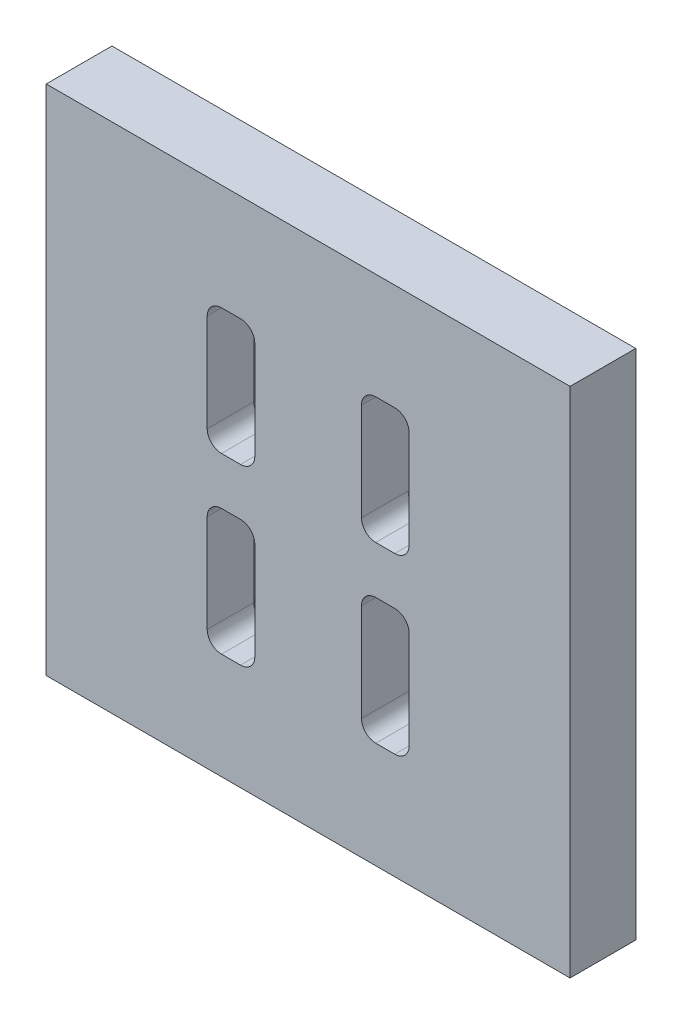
ISO-10303-21;
HEADER;
FILE_DESCRIPTION(('STEP AP214'),'2;1');
FILE_NAME('part.step','',(''),(''),'','','');
FILE_SCHEMA(('AUTOMOTIVE_DESIGN { 1 0 10303 214 1 1 1 1 }'));
ENDSEC;
DATA;
#1=APPLICATION_CONTEXT('core data for automotive mechanical design processes');
#2=APPLICATION_PROTOCOL_DEFINITION('international standard','automotive_design',2000,#1);
#3=PRODUCT_CONTEXT('',#1,'mechanical');
#4=PRODUCT('Part','Part','',(#3));
#5=PRODUCT_RELATED_PRODUCT_CATEGORY('part','',(#4));
#6=PRODUCT_DEFINITION_FORMATION('','',#4);
#7=PRODUCT_DEFINITION_CONTEXT('part definition',#1,'design');
#8=PRODUCT_DEFINITION('design','',#6,#7);
#9=PRODUCT_DEFINITION_SHAPE('','',#8);
#10=(LENGTH_UNIT() NAMED_UNIT(*) SI_UNIT(.MILLI.,.METRE.));
#11=(NAMED_UNIT(*) PLANE_ANGLE_UNIT() SI_UNIT($,.RADIAN.));
#12=(NAMED_UNIT(*) SI_UNIT($,.STERADIAN.) SOLID_ANGLE_UNIT());
#13=UNCERTAINTY_MEASURE_WITH_UNIT(LENGTH_MEASURE(1.E-05),#10,'distance_accuracy_value','');
#14=(GEOMETRIC_REPRESENTATION_CONTEXT(3) GLOBAL_UNCERTAINTY_ASSIGNED_CONTEXT((#13)) GLOBAL_UNIT_ASSIGNED_CONTEXT((#10,
#11,#12)) REPRESENTATION_CONTEXT('',''));
#15=CARTESIAN_POINT('',(0.,0.,0.));
#16=DIRECTION('',(0.,0.,1.));
#17=DIRECTION('',(1.,0.,0.));
#18=AXIS2_PLACEMENT_3D('',#15,#16,#17);
#19=CARTESIAN_POINT('',(0.,0.,8.763));
#20=DIRECTION('',(1.,0.,0.));
#21=DIRECTION('',(0.,0.,-1.));
#22=AXIS2_PLACEMENT_3D('',#19,#20,#21);
#23=PLANE('',#22);
#24=DIRECTION('',(0.,-1.,0.));
#25=VECTOR('',#24,1.);
#26=CARTESIAN_POINT('',(0.,0.,0.));
#27=LINE('',#26,#25);
#28=CARTESIAN_POINT('',(0.,68.326,0.));
#29=VERTEX_POINT('',#28);
#30=CARTESIAN_POINT('',(0.,0.,0.));
#31=VERTEX_POINT('',#30);
#32=EDGE_CURVE('E578',#29,#31,#27,.T.);
#33=ORIENTED_EDGE('',*,*,#32,.T.);
#34=DIRECTION('',(0.,0.,-1.));
#35=VECTOR('',#34,1.);
#36=CARTESIAN_POINT('',(0.,0.,8.763));
#37=LINE('',#36,#35);
#38=CARTESIAN_POINT('',(0.,0.,8.763));
#39=VERTEX_POINT('',#38);
#40=EDGE_CURVE('E621',#39,#31,#37,.T.);
#41=ORIENTED_EDGE('',*,*,#40,.F.);
#42=DIRECTION('',(0.,-1.,0.));
#43=VECTOR('',#42,1.);
#44=CARTESIAN_POINT('',(0.,0.,8.763));
#45=LINE('',#44,#43);
#46=CARTESIAN_POINT('',(0.,68.326,8.763));
#47=VERTEX_POINT('',#46);
#48=EDGE_CURVE('E595',#47,#39,#45,.T.);
#49=ORIENTED_EDGE('',*,*,#48,.F.);
#50=DIRECTION('',(0.,0.,-1.));
#51=VECTOR('',#50,1.);
#52=CARTESIAN_POINT('',(0.,68.326,8.763));
#53=LINE('',#52,#51);
#54=EDGE_CURVE('E605',#47,#29,#53,.T.);
#55=ORIENTED_EDGE('',*,*,#54,.T.);
#56=EDGE_LOOP('',(#33,#41,#49,#55));
#57=FACE_BOUND('',#56,.T.);
#58=ADVANCED_FACE('F32',(#57),#23,.F.);
#59=CARTESIAN_POINT('',(0.,0.,8.763));
#60=DIRECTION('',(0.,1.,0.));
#61=DIRECTION('',(0.,0.,1.));
#62=AXIS2_PLACEMENT_3D('',#59,#60,#61);
#63=PLANE('',#62);
#64=DIRECTION('',(1.,0.,0.));
#65=VECTOR('',#64,1.);
#66=CARTESIAN_POINT('',(0.,0.,0.));
#67=LINE('',#66,#65);
#68=CARTESIAN_POINT('',(69.85,0.,0.));
#69=VERTEX_POINT('',#68);
#70=EDGE_CURVE('E608',#31,#69,#67,.T.);
#71=ORIENTED_EDGE('',*,*,#70,.T.);
#72=DIRECTION('',(0.,0.,-1.));
#73=VECTOR('',#72,1.);
#74=CARTESIAN_POINT('',(69.85,0.,8.763));
#75=LINE('',#74,#73);
#76=CARTESIAN_POINT('',(69.85,0.,8.763));
#77=VERTEX_POINT('',#76);
#78=EDGE_CURVE('E618',#77,#69,#75,.T.);
#79=ORIENTED_EDGE('',*,*,#78,.F.);
#80=DIRECTION('',(1.,0.,0.));
#81=VECTOR('',#80,1.);
#82=CARTESIAN_POINT('',(0.,0.,8.763));
#83=LINE('',#82,#81);
#84=EDGE_CURVE('E598',#39,#77,#83,.T.);
#85=ORIENTED_EDGE('',*,*,#84,.F.);
#86=ORIENTED_EDGE('',*,*,#40,.T.);
#87=EDGE_LOOP('',(#71,#79,#85,#86));
#88=FACE_BOUND('',#87,.T.);
#89=ADVANCED_FACE('F750',(#88),#63,.F.);
#90=CARTESIAN_POINT('',(69.85,0.,8.763));
#91=DIRECTION('',(-1.,0.,0.));
#92=DIRECTION('',(0.,0.,1.));
#93=AXIS2_PLACEMENT_3D('',#90,#91,#92);
#94=PLANE('',#93);
#95=DIRECTION('',(0.,1.,0.));
#96=VECTOR('',#95,1.);
#97=CARTESIAN_POINT('',(69.85,0.,0.));
#98=LINE('',#97,#96);
#99=CARTESIAN_POINT('',(69.85,68.326,0.));
#100=VERTEX_POINT('',#99);
#101=EDGE_CURVE('E610',#69,#100,#98,.T.);
#102=ORIENTED_EDGE('',*,*,#101,.T.);
#103=DIRECTION('',(0.,0.,-1.));
#104=VECTOR('',#103,1.);
#105=CARTESIAN_POINT('',(69.85,68.326,8.763));
#106=LINE('',#105,#104);
#107=CARTESIAN_POINT('',(69.85,68.326,8.763));
#108=VERTEX_POINT('',#107);
#109=EDGE_CURVE('E615',#108,#100,#106,.T.);
#110=ORIENTED_EDGE('',*,*,#109,.F.);
#111=DIRECTION('',(0.,1.,0.));
#112=VECTOR('',#111,1.);
#113=CARTESIAN_POINT('',(69.85,0.,8.763));
#114=LINE('',#113,#112);
#115=EDGE_CURVE('E601',#77,#108,#114,.T.);
#116=ORIENTED_EDGE('',*,*,#115,.F.);
#117=ORIENTED_EDGE('',*,*,#78,.T.);
#118=EDGE_LOOP('',(#102,#110,#116,#117));
#119=FACE_BOUND('',#118,.T.);
#120=ADVANCED_FACE('F755',(#119),#94,.F.);
#121=CARTESIAN_POINT('',(0.,68.326,8.763));
#122=DIRECTION('',(0.,-1.,0.));
#123=DIRECTION('',(0.,0.,-1.));
#124=AXIS2_PLACEMENT_3D('',#121,#122,#123);
#125=PLANE('',#124);
#126=DIRECTION('',(-1.,0.,0.));
#127=VECTOR('',#126,1.);
#128=CARTESIAN_POINT('',(0.,68.326,0.));
#129=LINE('',#128,#127);
#130=EDGE_CURVE('E599',#100,#29,#129,.T.);
#131=ORIENTED_EDGE('',*,*,#130,.T.);
#132=ORIENTED_EDGE('',*,*,#54,.F.);
#133=DIRECTION('',(-1.,0.,0.));
#134=VECTOR('',#133,1.);
#135=CARTESIAN_POINT('',(0.,68.326,8.763));
#136=LINE('',#135,#134);
#137=EDGE_CURVE('E603',#108,#47,#136,.T.);
#138=ORIENTED_EDGE('',*,*,#137,.F.);
#139=ORIENTED_EDGE('',*,*,#109,.T.);
#140=EDGE_LOOP('',(#131,#132,#138,#139));
#141=FACE_BOUND('',#140,.T.);
#142=ADVANCED_FACE('F769',(#141),#125,.F.);
#143=CARTESIAN_POINT('',(0.,68.326,8.763));
#144=DIRECTION('',(0.,0.,-1.));
#145=DIRECTION('',(-1.,0.,0.));
#146=AXIS2_PLACEMENT_3D('',#143,#144,#145);
#147=PLANE('',#146);
#148=DIRECTION('',(-1.,0.,0.));
#149=VECTOR('',#148,1.);
#150=CARTESIAN_POINT('',(46.4820000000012,14.1605,8.763));
#151=LINE('',#150,#149);
#152=CARTESIAN_POINT('',(46.4820000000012,14.1605,8.763));
#153=VERTEX_POINT('',#152);
#154=CARTESIAN_POINT('',(43.9420000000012,14.1605,8.763));
#155=VERTEX_POINT('',#154);
#156=EDGE_CURVE('E337',#153,#155,#151,.T.);
#157=ORIENTED_EDGE('',*,*,#156,.T.);
#158=CARTESIAN_POINT('',(43.9420000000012,16.0655,8.763));
#159=DIRECTION('',(0.,0.,-1.));
#160=DIRECTION('',(-1.,0.,0.));
#161=AXIS2_PLACEMENT_3D('',#158,#159,#160);
#162=CIRCLE('',#161,1.90499999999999);
#163=CARTESIAN_POINT('',(42.0370000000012,16.0655,8.763));
#164=VERTEX_POINT('',#163);
#165=EDGE_CURVE('E317',#155,#164,#162,.T.);
#166=ORIENTED_EDGE('',*,*,#165,.T.);
#167=DIRECTION('',(0.,1.,0.));
#168=VECTOR('',#167,1.);
#169=CARTESIAN_POINT('',(42.0370000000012,16.0655,8.763));
#170=LINE('',#169,#168);
#171=CARTESIAN_POINT('',(42.0370000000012,29.083,8.763));
#172=VERTEX_POINT('',#171);
#173=EDGE_CURVE('E327',#164,#172,#170,.T.);
#174=ORIENTED_EDGE('',*,*,#173,.T.);
#175=CARTESIAN_POINT('',(43.9420000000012,29.083,8.763));
#176=DIRECTION('',(0.,0.,-1.));
#177=DIRECTION('',(1.,0.,0.));
#178=AXIS2_PLACEMENT_3D('',#175,#176,#177);
#179=CIRCLE('',#178,1.90499999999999);
#180=CARTESIAN_POINT('',(43.9420000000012,30.988,8.763));
#181=VERTEX_POINT('',#180);
#182=EDGE_CURVE('E46',#172,#181,#179,.T.);
#183=ORIENTED_EDGE('',*,*,#182,.T.);
#184=DIRECTION('',(1.,0.,0.));
#185=VECTOR('',#184,1.);
#186=CARTESIAN_POINT('',(46.4820000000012,30.988,8.763));
#187=LINE('',#186,#185);
#188=CARTESIAN_POINT('',(46.4820000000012,30.988,8.763));
#189=VERTEX_POINT('',#188);
#190=EDGE_CURVE('E341',#181,#189,#187,.T.);
#191=ORIENTED_EDGE('',*,*,#190,.T.);
#192=CARTESIAN_POINT('',(46.4820000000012,29.083,8.763));
#193=DIRECTION('',(0.,0.,-1.));
#194=DIRECTION('',(1.,0.,0.));
#195=AXIS2_PLACEMENT_3D('',#192,#193,#194);
#196=CIRCLE('',#195,1.90499999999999);
#197=CARTESIAN_POINT('',(48.3870000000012,29.083,8.763));
#198=VERTEX_POINT('',#197);
#199=EDGE_CURVE('E344',#189,#198,#196,.T.);
#200=ORIENTED_EDGE('',*,*,#199,.T.);
#201=DIRECTION('',(0.,-1.,0.));
#202=VECTOR('',#201,1.);
#203=CARTESIAN_POINT('',(48.3870000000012,16.0655,8.763));
#204=LINE('',#203,#202);
#205=CARTESIAN_POINT('',(48.3870000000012,16.0655,8.763));
#206=VERTEX_POINT('',#205);
#207=EDGE_CURVE('E347',#198,#206,#204,.T.);
#208=ORIENTED_EDGE('',*,*,#207,.T.);
#209=CARTESIAN_POINT('',(46.4820000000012,16.0655,8.763));
#210=DIRECTION('',(0.,0.,-1.));
#211=DIRECTION('',(1.,0.,0.));
#212=AXIS2_PLACEMENT_3D('',#209,#210,#211);
#213=CIRCLE('',#212,1.905);
#214=EDGE_CURVE('E350',#206,#153,#213,.T.);
#215=ORIENTED_EDGE('',*,*,#214,.T.);
#216=EDGE_LOOP('',(#157,#166,#174,#183,#191,#200,#208,#215));
#217=FACE_BOUND('',#216,.T.);
#218=DIRECTION('',(0.,-1.,0.));
#219=VECTOR('',#218,1.);
#220=CARTESIAN_POINT('',(27.8129999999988,16.0655,8.763));
#221=LINE('',#220,#219);
#222=CARTESIAN_POINT('',(27.8129999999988,29.083,8.763));
#223=VERTEX_POINT('',#222);
#224=CARTESIAN_POINT('',(27.8129999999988,16.0655,8.763));
#225=VERTEX_POINT('',#224);
#226=EDGE_CURVE('E388',#223,#225,#221,.T.);
#227=ORIENTED_EDGE('',*,*,#226,.T.);
#228=CARTESIAN_POINT('',(25.9079999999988,16.0655,8.763));
#229=DIRECTION('',(0.,0.,-1.));
#230=DIRECTION('',(1.,0.,0.));
#231=AXIS2_PLACEMENT_3D('',#228,#229,#230);
#232=CIRCLE('',#231,1.90499999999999);
#233=CARTESIAN_POINT('',(25.9079999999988,14.1605,8.763));
#234=VERTEX_POINT('',#233);
#235=EDGE_CURVE('E356',#225,#234,#232,.T.);
#236=ORIENTED_EDGE('',*,*,#235,.T.);
#237=DIRECTION('',(-1.,0.,0.));
#238=VECTOR('',#237,1.);
#239=CARTESIAN_POINT('',(23.3679999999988,14.1605,8.763));
#240=LINE('',#239,#238);
#241=CARTESIAN_POINT('',(23.3679999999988,14.1605,8.763));
#242=VERTEX_POINT('',#241);
#243=EDGE_CURVE('E372',#234,#242,#240,.T.);
#244=ORIENTED_EDGE('',*,*,#243,.T.);
#245=CARTESIAN_POINT('',(23.3679999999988,16.0655,8.763));
#246=DIRECTION('',(0.,0.,-1.));
#247=DIRECTION('',(-1.,0.,0.));
#248=AXIS2_PLACEMENT_3D('',#245,#246,#247);
#249=CIRCLE('',#248,1.905);
#250=CARTESIAN_POINT('',(21.4629999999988,16.0655,8.763));
#251=VERTEX_POINT('',#250);
#252=EDGE_CURVE('E54',#242,#251,#249,.T.);
#253=ORIENTED_EDGE('',*,*,#252,.T.);
#254=DIRECTION('',(0.,1.,0.));
#255=VECTOR('',#254,1.);
#256=CARTESIAN_POINT('',(21.4629999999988,16.0655,8.763));
#257=LINE('',#256,#255);
#258=CARTESIAN_POINT('',(21.4629999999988,29.083,8.763));
#259=VERTEX_POINT('',#258);
#260=EDGE_CURVE('E376',#251,#259,#257,.T.);
#261=ORIENTED_EDGE('',*,*,#260,.T.);
#262=CARTESIAN_POINT('',(23.3679999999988,29.083,8.763));
#263=DIRECTION('',(0.,0.,-1.));
#264=DIRECTION('',(-1.,0.,0.));
#265=AXIS2_PLACEMENT_3D('',#262,#263,#264);
#266=CIRCLE('',#265,1.90499999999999);
#267=CARTESIAN_POINT('',(23.3679999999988,30.988,8.763));
#268=VERTEX_POINT('',#267);
#269=EDGE_CURVE('E379',#259,#268,#266,.T.);
#270=ORIENTED_EDGE('',*,*,#269,.T.);
#271=DIRECTION('',(1.,0.,0.));
#272=VECTOR('',#271,1.);
#273=CARTESIAN_POINT('',(23.3679999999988,30.988,8.763));
#274=LINE('',#273,#272);
#275=CARTESIAN_POINT('',(25.9079999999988,30.988,8.763));
#276=VERTEX_POINT('',#275);
#277=EDGE_CURVE('E382',#268,#276,#274,.T.);
#278=ORIENTED_EDGE('',*,*,#277,.T.);
#279=CARTESIAN_POINT('',(25.9079999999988,29.083,8.763));
#280=DIRECTION('',(0.,0.,-1.));
#281=DIRECTION('',(-1.,0.,0.));
#282=AXIS2_PLACEMENT_3D('',#279,#280,#281);
#283=CIRCLE('',#282,1.905);
#284=EDGE_CURVE('E385',#276,#223,#283,.T.);
#285=ORIENTED_EDGE('',*,*,#284,.T.);
#286=EDGE_LOOP('',(#227,#236,#244,#253,#261,#270,#278,#285));
#287=FACE_BOUND('',#286,.T.);
#288=DIRECTION('',(0.,1.,0.));
#289=VECTOR('',#288,1.);
#290=CARTESIAN_POINT('',(21.4629999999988,52.2605,8.763));
#291=LINE('',#290,#289);
#292=CARTESIAN_POINT('',(21.4629999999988,39.243,8.763));
#293=VERTEX_POINT('',#292);
#294=CARTESIAN_POINT('',(21.4629999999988,52.2605,8.763));
#295=VERTEX_POINT('',#294);
#296=EDGE_CURVE('E429',#293,#295,#291,.T.);
#297=ORIENTED_EDGE('',*,*,#296,.T.);
#298=CARTESIAN_POINT('',(23.3679999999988,52.2605,8.763));
#299=DIRECTION('',(0.,0.,-1.));
#300=DIRECTION('',(1.,0.,0.));
#301=AXIS2_PLACEMENT_3D('',#298,#299,#300);
#302=CIRCLE('',#301,1.905);
#303=CARTESIAN_POINT('',(23.3679999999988,54.1655,8.763));
#304=VERTEX_POINT('',#303);
#305=EDGE_CURVE('E395',#295,#304,#302,.T.);
#306=ORIENTED_EDGE('',*,*,#305,.T.);
#307=DIRECTION('',(1.,0.,0.));
#308=VECTOR('',#307,1.);
#309=CARTESIAN_POINT('',(23.3679999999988,54.1655,8.763));
#310=LINE('',#309,#308);
#311=CARTESIAN_POINT('',(25.9079999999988,54.1655,8.763));
#312=VERTEX_POINT('',#311);
#313=EDGE_CURVE('E411',#304,#312,#310,.T.);
#314=ORIENTED_EDGE('',*,*,#313,.T.);
#315=CARTESIAN_POINT('',(25.9079999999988,52.2605,8.763));
#316=DIRECTION('',(0.,0.,-1.));
#317=DIRECTION('',(-1.,0.,0.));
#318=AXIS2_PLACEMENT_3D('',#315,#316,#317);
#319=CIRCLE('',#318,1.90500000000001);
#320=CARTESIAN_POINT('',(27.8129999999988,52.2605,8.763));
#321=VERTEX_POINT('',#320);
#322=EDGE_CURVE('E414',#312,#321,#319,.T.);
#323=ORIENTED_EDGE('',*,*,#322,.T.);
#324=DIRECTION('',(0.,-1.,0.));
#325=VECTOR('',#324,1.);
#326=CARTESIAN_POINT('',(27.8129999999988,52.2605,8.763));
#327=LINE('',#326,#325);
#328=CARTESIAN_POINT('',(27.8129999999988,39.243,8.763));
#329=VERTEX_POINT('',#328);
#330=EDGE_CURVE('E417',#321,#329,#327,.T.);
#331=ORIENTED_EDGE('',*,*,#330,.T.);
#332=CARTESIAN_POINT('',(25.9079999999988,39.243,8.763));
#333=DIRECTION('',(0.,0.,-1.));
#334=DIRECTION('',(1.,0.,0.));
#335=AXIS2_PLACEMENT_3D('',#332,#333,#334);
#336=CIRCLE('',#335,1.905);
#337=CARTESIAN_POINT('',(25.9079999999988,37.338,8.763));
#338=VERTEX_POINT('',#337);
#339=EDGE_CURVE('E420',#329,#338,#336,.T.);
#340=ORIENTED_EDGE('',*,*,#339,.T.);
#341=DIRECTION('',(-1.,0.,0.));
#342=VECTOR('',#341,1.);
#343=CARTESIAN_POINT('',(23.3679999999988,37.338,8.763));
#344=LINE('',#343,#342);
#345=CARTESIAN_POINT('',(23.3679999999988,37.338,8.763));
#346=VERTEX_POINT('',#345);
#347=EDGE_CURVE('E423',#338,#346,#344,.T.);
#348=ORIENTED_EDGE('',*,*,#347,.T.);
#349=CARTESIAN_POINT('',(23.3679999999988,39.243,8.763));
#350=DIRECTION('',(0.,0.,-1.));
#351=DIRECTION('',(1.,0.,0.));
#352=AXIS2_PLACEMENT_3D('',#349,#350,#351);
#353=CIRCLE('',#352,1.90499999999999);
#354=EDGE_CURVE('E426',#346,#293,#353,.T.);
#355=ORIENTED_EDGE('',*,*,#354,.T.);
#356=EDGE_LOOP('',(#297,#306,#314,#323,#331,#340,#348,#355));
#357=FACE_BOUND('',#356,.T.);
#358=DIRECTION('',(0.,-1.,0.));
#359=VECTOR('',#358,1.);
#360=CARTESIAN_POINT('',(48.3870000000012,52.2605,8.763));
#361=LINE('',#360,#359);
#362=CARTESIAN_POINT('',(48.3870000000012,52.2605,8.763));
#363=VERTEX_POINT('',#362);
#364=CARTESIAN_POINT('',(48.3870000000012,39.243,8.763));
#365=VERTEX_POINT('',#364);
#366=EDGE_CURVE('E469',#363,#365,#361,.T.);
#367=ORIENTED_EDGE('',*,*,#366,.T.);
#368=CARTESIAN_POINT('',(46.4820000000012,39.243,8.763));
#369=DIRECTION('',(0.,0.,-1.));
#370=DIRECTION('',(-1.,0.,0.));
#371=AXIS2_PLACEMENT_3D('',#368,#369,#370);
#372=CIRCLE('',#371,1.90499999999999);
#373=CARTESIAN_POINT('',(46.4820000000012,37.338,8.763));
#374=VERTEX_POINT('',#373);
#375=EDGE_CURVE('E436',#365,#374,#372,.T.);
#376=ORIENTED_EDGE('',*,*,#375,.T.);
#377=DIRECTION('',(-1.,0.,0.));
#378=VECTOR('',#377,1.);
#379=CARTESIAN_POINT('',(46.4820000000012,37.338,8.763));
#380=LINE('',#379,#378);
#381=CARTESIAN_POINT('',(43.9420000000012,37.338,8.763));
#382=VERTEX_POINT('',#381);
#383=EDGE_CURVE('E451',#374,#382,#380,.T.);
#384=ORIENTED_EDGE('',*,*,#383,.T.);
#385=CARTESIAN_POINT('',(43.9420000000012,39.243,8.763));
#386=DIRECTION('',(0.,0.,-1.));
#387=DIRECTION('',(-1.,0.,0.));
#388=AXIS2_PLACEMENT_3D('',#385,#386,#387);
#389=CIRCLE('',#388,1.905);
#390=CARTESIAN_POINT('',(42.0370000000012,39.243,8.763));
#391=VERTEX_POINT('',#390);
#392=EDGE_CURVE('E454',#382,#391,#389,.T.);
#393=ORIENTED_EDGE('',*,*,#392,.T.);
#394=DIRECTION('',(0.,1.,0.));
#395=VECTOR('',#394,1.);
#396=CARTESIAN_POINT('',(42.0370000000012,52.2605,8.763));
#397=LINE('',#396,#395);
#398=CARTESIAN_POINT('',(42.0370000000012,52.2605,8.763));
#399=VERTEX_POINT('',#398);
#400=EDGE_CURVE('E457',#391,#399,#397,.T.);
#401=ORIENTED_EDGE('',*,*,#400,.T.);
#402=CARTESIAN_POINT('',(43.9420000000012,52.2605,8.763));
#403=DIRECTION('',(0.,0.,-1.));
#404=DIRECTION('',(1.,0.,0.));
#405=AXIS2_PLACEMENT_3D('',#402,#403,#404);
#406=CIRCLE('',#405,1.905);
#407=CARTESIAN_POINT('',(43.9420000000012,54.1655,8.763));
#408=VERTEX_POINT('',#407);
#409=EDGE_CURVE('E460',#399,#408,#406,.T.);
#410=ORIENTED_EDGE('',*,*,#409,.T.);
#411=DIRECTION('',(1.,0.,0.));
#412=VECTOR('',#411,1.);
#413=CARTESIAN_POINT('',(46.4820000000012,54.1655,8.763));
#414=LINE('',#413,#412);
#415=CARTESIAN_POINT('',(46.4820000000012,54.1655,8.763));
#416=VERTEX_POINT('',#415);
#417=EDGE_CURVE('E463',#408,#416,#414,.T.);
#418=ORIENTED_EDGE('',*,*,#417,.T.);
#419=CARTESIAN_POINT('',(46.4820000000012,52.2605,8.763));
#420=DIRECTION('',(0.,0.,-1.));
#421=DIRECTION('',(-1.,0.,0.));
#422=AXIS2_PLACEMENT_3D('',#419,#420,#421);
#423=CIRCLE('',#422,1.905);
#424=EDGE_CURVE('E466',#416,#363,#423,.T.);
#425=ORIENTED_EDGE('',*,*,#424,.T.);
#426=EDGE_LOOP('',(#367,#376,#384,#393,#401,#410,#418,#425));
#427=FACE_BOUND('',#426,.T.);
#428=ORIENTED_EDGE('',*,*,#48,.T.);
#429=ORIENTED_EDGE('',*,*,#84,.T.);
#430=ORIENTED_EDGE('',*,*,#115,.T.);
#431=ORIENTED_EDGE('',*,*,#137,.T.);
#432=EDGE_LOOP('',(#428,#429,#430,#431));
#433=FACE_BOUND('',#432,.T.);
#434=ADVANCED_FACE('F333',(#217,#287,#357,#427,#433),#147,.F.);
#435=CARTESIAN_POINT('',(0.,68.326,0.));
#436=DIRECTION('',(0.,0.,-1.));
#437=DIRECTION('',(-1.,0.,0.));
#438=AXIS2_PLACEMENT_3D('',#435,#436,#437);
#439=PLANE('',#438);
#440=CARTESIAN_POINT('',(59.1820000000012,16.0655,0.));
#441=DIRECTION('',(0.,0.,-1.));
#442=DIRECTION('',(1.,0.,0.));
#443=AXIS2_PLACEMENT_3D('',#440,#441,#442);
#444=CIRCLE('',#443,1.905);
#445=CARTESIAN_POINT('',(61.0870000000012,16.0655,0.));
#446=VERTEX_POINT('',#445);
#447=CARTESIAN_POINT('',(59.1820000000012,14.1605,0.));
#448=VERTEX_POINT('',#447);
#449=EDGE_CURVE('E476',#446,#448,#444,.T.);
#450=ORIENTED_EDGE('',*,*,#449,.F.);
#451=DIRECTION('',(0.,-1.,0.));
#452=VECTOR('',#451,1.);
#453=CARTESIAN_POINT('',(61.0870000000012,52.2605,0.));
#454=LINE('',#453,#452);
#455=CARTESIAN_POINT('',(61.0870000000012,52.2605,0.));
#456=VERTEX_POINT('',#455);
#457=EDGE_CURVE('E493',#456,#446,#454,.T.);
#458=ORIENTED_EDGE('',*,*,#457,.F.);
#459=CARTESIAN_POINT('',(59.1820000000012,52.2605,0.));
#460=DIRECTION('',(0.,0.,-1.));
#461=DIRECTION('',(-1.,0.,0.));
#462=AXIS2_PLACEMENT_3D('',#459,#460,#461);
#463=CIRCLE('',#462,1.905);
#464=CARTESIAN_POINT('',(59.1820000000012,54.1655,0.));
#465=VERTEX_POINT('',#464);
#466=EDGE_CURVE('E518',#465,#456,#463,.T.);
#467=ORIENTED_EDGE('',*,*,#466,.F.);
#468=DIRECTION('',(1.,0.,0.));
#469=VECTOR('',#468,1.);
#470=CARTESIAN_POINT('',(59.1820000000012,54.1655,0.));
#471=LINE('',#470,#469);
#472=CARTESIAN_POINT('',(43.9420000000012,54.1655,0.));
#473=VERTEX_POINT('',#472);
#474=EDGE_CURVE('E516',#473,#465,#471,.T.);
#475=ORIENTED_EDGE('',*,*,#474,.F.);
#476=CARTESIAN_POINT('',(43.9420000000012,52.2605,0.));
#477=DIRECTION('',(0.,0.,-1.));
#478=DIRECTION('',(1.,0.,0.));
#479=AXIS2_PLACEMENT_3D('',#476,#477,#478);
#480=CIRCLE('',#479,1.90499999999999);
#481=CARTESIAN_POINT('',(42.0370000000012,52.2605,0.));
#482=VERTEX_POINT('',#481);
#483=EDGE_CURVE('E513',#482,#473,#480,.T.);
#484=ORIENTED_EDGE('',*,*,#483,.F.);
#485=DIRECTION('',(0.,1.,0.));
#486=VECTOR('',#485,1.);
#487=CARTESIAN_POINT('',(42.0370000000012,52.2605,0.));
#488=LINE('',#487,#486);
#489=CARTESIAN_POINT('',(42.0370000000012,16.0655,0.));
#490=VERTEX_POINT('',#489);
#491=EDGE_CURVE('E511',#490,#482,#488,.T.);
#492=ORIENTED_EDGE('',*,*,#491,.F.);
#493=CARTESIAN_POINT('',(43.9420000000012,16.0655,0.));
#494=DIRECTION('',(0.,0.,-1.));
#495=DIRECTION('',(1.,0.,0.));
#496=AXIS2_PLACEMENT_3D('',#493,#494,#495);
#497=CIRCLE('',#496,1.905);
#498=CARTESIAN_POINT('',(43.9420000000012,14.1605,0.));
#499=VERTEX_POINT('',#498);
#500=EDGE_CURVE('E320',#499,#490,#497,.T.);
#501=ORIENTED_EDGE('',*,*,#500,.F.);
#502=DIRECTION('',(-1.,0.,0.));
#503=VECTOR('',#502,1.);
#504=CARTESIAN_POINT('',(59.1820000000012,14.1605,0.));
#505=LINE('',#504,#503);
#506=EDGE_CURVE('E508',#448,#499,#505,.T.);
#507=ORIENTED_EDGE('',*,*,#506,.F.);
#508=EDGE_LOOP('',(#450,#458,#467,#475,#484,#492,#501,#507));
#509=FACE_BOUND('',#508,.T.);
#510=CARTESIAN_POINT('',(25.9080000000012,52.2605,0.));
#511=DIRECTION('',(0.,0.,-1.));
#512=DIRECTION('',(1.,0.,0.));
#513=AXIS2_PLACEMENT_3D('',#510,#511,#512);
#514=CIRCLE('',#513,1.905);
#515=CARTESIAN_POINT('',(25.9080000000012,54.1655,0.));
#516=VERTEX_POINT('',#515);
#517=CARTESIAN_POINT('',(27.8130000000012,52.2605,0.));
#518=VERTEX_POINT('',#517);
#519=EDGE_CURVE('E525',#516,#518,#514,.T.);
#520=ORIENTED_EDGE('',*,*,#519,.F.);
#521=DIRECTION('',(1.,0.,0.));
#522=VECTOR('',#521,1.);
#523=CARTESIAN_POINT('',(25.9080000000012,54.1655,0.));
#524=LINE('',#523,#522);
#525=CARTESIAN_POINT('',(10.6680000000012,54.1655,0.));
#526=VERTEX_POINT('',#525);
#527=EDGE_CURVE('E542',#526,#516,#524,.T.);
#528=ORIENTED_EDGE('',*,*,#527,.F.);
#529=CARTESIAN_POINT('',(10.6680000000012,52.2605,0.));
#530=DIRECTION('',(0.,0.,-1.));
#531=DIRECTION('',(-1.,0.,0.));
#532=AXIS2_PLACEMENT_3D('',#529,#530,#531);
#533=CIRCLE('',#532,1.905);
#534=CARTESIAN_POINT('',(8.76300000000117,52.2605,0.));
#535=VERTEX_POINT('',#534);
#536=EDGE_CURVE('E571',#535,#526,#533,.T.);
#537=ORIENTED_EDGE('',*,*,#536,.F.);
#538=DIRECTION('',(0.,1.,0.));
#539=VECTOR('',#538,1.);
#540=CARTESIAN_POINT('',(8.76300000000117,52.2605,0.));
#541=LINE('',#540,#539);
#542=CARTESIAN_POINT('',(8.76300000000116,16.0655,0.));
#543=VERTEX_POINT('',#542);
#544=EDGE_CURVE('E568',#543,#535,#541,.T.);
#545=ORIENTED_EDGE('',*,*,#544,.F.);
#546=CARTESIAN_POINT('',(10.6680000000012,16.0655,0.));
#547=DIRECTION('',(0.,0.,-1.));
#548=DIRECTION('',(-1.,0.,0.));
#549=AXIS2_PLACEMENT_3D('',#546,#547,#548);
#550=CIRCLE('',#549,1.905);
#551=CARTESIAN_POINT('',(10.6680000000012,14.1605,0.));
#552=VERTEX_POINT('',#551);
#553=EDGE_CURVE('E565',#552,#543,#550,.T.);
#554=ORIENTED_EDGE('',*,*,#553,.F.);
#555=DIRECTION('',(-1.,0.,0.));
#556=VECTOR('',#555,1.);
#557=CARTESIAN_POINT('',(25.9080000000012,14.1605,0.));
#558=LINE('',#557,#556);
#559=CARTESIAN_POINT('',(25.9080000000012,14.1605,0.));
#560=VERTEX_POINT('',#559);
#561=EDGE_CURVE('E563',#560,#552,#558,.T.);
#562=ORIENTED_EDGE('',*,*,#561,.F.);
#563=CARTESIAN_POINT('',(25.9080000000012,16.0655,0.));
#564=DIRECTION('',(0.,0.,-1.));
#565=DIRECTION('',(-1.,0.,0.));
#566=AXIS2_PLACEMENT_3D('',#563,#564,#565);
#567=CIRCLE('',#566,1.905);
#568=CARTESIAN_POINT('',(27.8130000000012,16.0655,0.));
#569=VERTEX_POINT('',#568);
#570=EDGE_CURVE('E560',#569,#560,#567,.T.);
#571=ORIENTED_EDGE('',*,*,#570,.F.);
#572=DIRECTION('',(0.,-1.,0.));
#573=VECTOR('',#572,1.);
#574=CARTESIAN_POINT('',(27.8130000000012,52.2605,0.));
#575=LINE('',#574,#573);
#576=EDGE_CURVE('E558',#518,#569,#575,.T.);
#577=ORIENTED_EDGE('',*,*,#576,.F.);
#578=EDGE_LOOP('',(#520,#528,#537,#545,#554,#562,#571,#577));
#579=FACE_BOUND('',#578,.T.);
#580=ORIENTED_EDGE('',*,*,#32,.F.);
#581=ORIENTED_EDGE('',*,*,#130,.F.);
#582=ORIENTED_EDGE('',*,*,#101,.F.);
#583=ORIENTED_EDGE('',*,*,#70,.F.);
#584=EDGE_LOOP('',(#580,#581,#582,#583));
#585=FACE_BOUND('',#584,.T.);
#586=ADVANCED_FACE('F732',(#509,#579,#585),#439,.T.);
#587=CARTESIAN_POINT('',(25.9080000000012,52.2605,2.54));
#588=DIRECTION('',(0.,0.,-1.));
#589=DIRECTION('',(-1.,0.,0.));
#590=AXIS2_PLACEMENT_3D('',#587,#588,#589);
#591=CYLINDRICAL_SURFACE('',#590,1.905);
#592=ORIENTED_EDGE('',*,*,#519,.T.);
#593=DIRECTION('',(0.,0.,-1.));
#594=VECTOR('',#593,1.);
#595=CARTESIAN_POINT('',(27.8130000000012,52.2605,2.54));
#596=LINE('',#595,#594);
#597=EDGE_CURVE('E556',#321,#518,#596,.T.);
#598=ORIENTED_EDGE('',*,*,#597,.F.);
#599=ORIENTED_EDGE('',*,*,#322,.F.);
#600=DIRECTION('',(0.,0.,-1.));
#601=VECTOR('',#600,1.);
#602=CARTESIAN_POINT('',(25.9080000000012,54.1655,2.54));
#603=LINE('',#602,#601);
#604=EDGE_CURVE('E575',#312,#516,#603,.T.);
#605=ORIENTED_EDGE('',*,*,#604,.T.);
#606=EDGE_LOOP('',(#592,#598,#599,#605));
#607=FACE_BOUND('',#606,.T.);
#608=ADVANCED_FACE('F780',(#607),#591,.F.);
#609=CARTESIAN_POINT('',(25.9080000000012,54.1655,2.54));
#610=DIRECTION('',(0.,1.,0.));
#611=DIRECTION('',(0.,0.,1.));
#612=AXIS2_PLACEMENT_3D('',#609,#610,#611);
#613=PLANE('',#612);
#614=ORIENTED_EDGE('',*,*,#604,.F.);
#615=ORIENTED_EDGE('',*,*,#313,.F.);
#616=DIRECTION('',(0.,0.,-1.));
#617=VECTOR('',#616,1.);
#618=CARTESIAN_POINT('',(23.3679999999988,54.1655,8.763));
#619=LINE('',#618,#617);
#620=CARTESIAN_POINT('',(23.3679999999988,54.1655,2.54));
#621=VERTEX_POINT('',#620);
#622=EDGE_CURVE('E432',#304,#621,#619,.T.);
#623=ORIENTED_EDGE('',*,*,#622,.T.);
#624=DIRECTION('',(1.,0.,0.));
#625=VECTOR('',#624,1.);
#626=CARTESIAN_POINT('',(25.9080000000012,54.1655,2.54));
#627=LINE('',#626,#625);
#628=CARTESIAN_POINT('',(10.6680000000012,54.1655,2.54));
#629=VERTEX_POINT('',#628);
#630=EDGE_CURVE('E553',#629,#621,#627,.T.);
#631=ORIENTED_EDGE('',*,*,#630,.F.);
#632=DIRECTION('',(0.,0.,-1.));
#633=VECTOR('',#632,1.);
#634=CARTESIAN_POINT('',(10.6680000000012,54.1655,2.54));
#635=LINE('',#634,#633);
#636=EDGE_CURVE('E579',#629,#526,#635,.T.);
#637=ORIENTED_EDGE('',*,*,#636,.T.);
#638=ORIENTED_EDGE('',*,*,#527,.T.);
#639=EDGE_LOOP('',(#614,#615,#623,#631,#637,#638));
#640=FACE_BOUND('',#639,.T.);
#641=ADVANCED_FACE('F785',(#640),#613,.F.);
#642=CARTESIAN_POINT('',(10.6680000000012,52.2605,2.54));
#643=DIRECTION('',(0.,0.,-1.));
#644=DIRECTION('',(-1.,0.,0.));
#645=AXIS2_PLACEMENT_3D('',#642,#643,#644);
#646=CYLINDRICAL_SURFACE('',#645,1.905);
#647=ORIENTED_EDGE('',*,*,#536,.T.);
#648=ORIENTED_EDGE('',*,*,#636,.F.);
#649=CARTESIAN_POINT('',(10.6680000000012,52.2605,2.54));
#650=DIRECTION('',(0.,0.,-1.));
#651=DIRECTION('',(-1.,0.,0.));
#652=AXIS2_PLACEMENT_3D('',#649,#650,#651);
#653=CIRCLE('',#652,1.905);
#654=CARTESIAN_POINT('',(8.76300000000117,52.2605,2.54));
#655=VERTEX_POINT('',#654);
#656=EDGE_CURVE('E550',#655,#629,#653,.T.);
#657=ORIENTED_EDGE('',*,*,#656,.F.);
#658=DIRECTION('',(0.,0.,-1.));
#659=VECTOR('',#658,1.);
#660=CARTESIAN_POINT('',(8.76300000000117,52.2605,2.54));
#661=LINE('',#660,#659);
#662=EDGE_CURVE('E581',#655,#535,#661,.T.);
#663=ORIENTED_EDGE('',*,*,#662,.T.);
#664=EDGE_LOOP('',(#647,#648,#657,#663));
#665=FACE_BOUND('',#664,.T.);
#666=ADVANCED_FACE('F807',(#665),#646,.F.);
#667=CARTESIAN_POINT('',(8.76300000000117,52.2605,2.54));
#668=DIRECTION('',(-1.,0.,0.));
#669=DIRECTION('',(0.,-1.,0.));
#670=AXIS2_PLACEMENT_3D('',#667,#668,#669);
#671=PLANE('',#670);
#672=ORIENTED_EDGE('',*,*,#544,.T.);
#673=ORIENTED_EDGE('',*,*,#662,.F.);
#674=DIRECTION('',(0.,1.,0.));
#675=VECTOR('',#674,1.);
#676=CARTESIAN_POINT('',(8.76300000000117,52.2605,2.54));
#677=LINE('',#676,#675);
#678=CARTESIAN_POINT('',(8.76300000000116,16.0655,2.54));
#679=VERTEX_POINT('',#678);
#680=EDGE_CURVE('E547',#679,#655,#677,.T.);
#681=ORIENTED_EDGE('',*,*,#680,.F.);
#682=DIRECTION('',(0.,0.,-1.));
#683=VECTOR('',#682,1.);
#684=CARTESIAN_POINT('',(8.76300000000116,16.0655,2.54));
#685=LINE('',#684,#683);
#686=EDGE_CURVE('E583',#679,#543,#685,.T.);
#687=ORIENTED_EDGE('',*,*,#686,.T.);
#688=EDGE_LOOP('',(#672,#673,#681,#687));
#689=FACE_BOUND('',#688,.T.);
#690=ADVANCED_FACE('F803',(#689),#671,.F.);
#691=CARTESIAN_POINT('',(10.6680000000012,16.0655,2.54));
#692=DIRECTION('',(0.,0.,-1.));
#693=DIRECTION('',(-1.,0.,0.));
#694=AXIS2_PLACEMENT_3D('',#691,#692,#693);
#695=CYLINDRICAL_SURFACE('',#694,1.905);
#696=ORIENTED_EDGE('',*,*,#553,.T.);
#697=ORIENTED_EDGE('',*,*,#686,.F.);
#698=CARTESIAN_POINT('',(10.6680000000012,16.0655,2.54));
#699=DIRECTION('',(0.,0.,-1.));
#700=DIRECTION('',(-1.,0.,0.));
#701=AXIS2_PLACEMENT_3D('',#698,#699,#700);
#702=CIRCLE('',#701,1.905);
#703=CARTESIAN_POINT('',(10.6680000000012,14.1605,2.54));
#704=VERTEX_POINT('',#703);
#705=EDGE_CURVE('E544',#704,#679,#702,.T.);
#706=ORIENTED_EDGE('',*,*,#705,.F.);
#707=DIRECTION('',(0.,0.,-1.));
#708=VECTOR('',#707,1.);
#709=CARTESIAN_POINT('',(10.6680000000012,14.1605,2.54));
#710=LINE('',#709,#708);
#711=EDGE_CURVE('E585',#704,#552,#710,.T.);
#712=ORIENTED_EDGE('',*,*,#711,.T.);
#713=EDGE_LOOP('',(#696,#697,#706,#712));
#714=FACE_BOUND('',#713,.T.);
#715=ADVANCED_FACE('F799',(#714),#695,.F.);
#716=CARTESIAN_POINT('',(25.9080000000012,14.1605,2.54));
#717=DIRECTION('',(0.,-1.,0.));
#718=DIRECTION('',(0.,0.,-1.));
#719=AXIS2_PLACEMENT_3D('',#716,#717,#718);
#720=PLANE('',#719);
#721=DIRECTION('',(-1.,0.,0.));
#722=VECTOR('',#721,1.);
#723=CARTESIAN_POINT('',(25.9080000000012,14.1605,2.54));
#724=LINE('',#723,#722);
#725=CARTESIAN_POINT('',(23.3679999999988,14.1605,2.54));
#726=VERTEX_POINT('',#725);
#727=EDGE_CURVE('E541',#726,#704,#724,.T.);
#728=ORIENTED_EDGE('',*,*,#727,.F.);
#729=DIRECTION('',(0.,0.,-1.));
#730=VECTOR('',#729,1.);
#731=CARTESIAN_POINT('',(23.3679999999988,14.1605,8.763));
#732=LINE('',#731,#730);
#733=EDGE_CURVE('E391',#242,#726,#732,.T.);
#734=ORIENTED_EDGE('',*,*,#733,.F.);
#735=ORIENTED_EDGE('',*,*,#243,.F.);
#736=DIRECTION('',(0.,0.,-1.));
#737=VECTOR('',#736,1.);
#738=CARTESIAN_POINT('',(25.9080000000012,14.1605,2.54));
#739=LINE('',#738,#737);
#740=EDGE_CURVE('E588',#234,#560,#739,.T.);
#741=ORIENTED_EDGE('',*,*,#740,.T.);
#742=ORIENTED_EDGE('',*,*,#561,.T.);
#743=ORIENTED_EDGE('',*,*,#711,.F.);
#744=EDGE_LOOP('',(#728,#734,#735,#741,#742,#743));
#745=FACE_BOUND('',#744,.T.);
#746=ADVANCED_FACE('F795',(#745),#720,.F.);
#747=CARTESIAN_POINT('',(25.9080000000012,16.0655,2.54));
#748=DIRECTION('',(0.,0.,-1.));
#749=DIRECTION('',(-1.,0.,0.));
#750=AXIS2_PLACEMENT_3D('',#747,#748,#749);
#751=CYLINDRICAL_SURFACE('',#750,1.905);
#752=ORIENTED_EDGE('',*,*,#570,.T.);
#753=ORIENTED_EDGE('',*,*,#740,.F.);
#754=ORIENTED_EDGE('',*,*,#235,.F.);
#755=DIRECTION('',(0.,0.,-1.));
#756=VECTOR('',#755,1.);
#757=CARTESIAN_POINT('',(27.8130000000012,16.0655,2.54));
#758=LINE('',#757,#756);
#759=EDGE_CURVE('E590',#225,#569,#758,.T.);
#760=ORIENTED_EDGE('',*,*,#759,.T.);
#761=EDGE_LOOP('',(#752,#753,#754,#760));
#762=FACE_BOUND('',#761,.T.);
#763=ADVANCED_FACE('F791',(#762),#751,.F.);
#764=CARTESIAN_POINT('',(27.8130000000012,52.2605,2.54));
#765=DIRECTION('',(1.,0.,0.));
#766=DIRECTION('',(0.,0.,-1.));
#767=AXIS2_PLACEMENT_3D('',#764,#765,#766);
#768=PLANE('',#767);
#769=ORIENTED_EDGE('',*,*,#759,.F.);
#770=ORIENTED_EDGE('',*,*,#226,.F.);
#771=DIRECTION('',(0.,0.,-1.));
#772=VECTOR('',#771,1.);
#773=CARTESIAN_POINT('',(27.8129999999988,29.083,8.763));
#774=LINE('',#773,#772);
#775=CARTESIAN_POINT('',(27.8129999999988,29.083,2.54));
#776=VERTEX_POINT('',#775);
#777=EDGE_CURVE('E392',#223,#776,#774,.T.);
#778=ORIENTED_EDGE('',*,*,#777,.T.);
#779=DIRECTION('',(0.,-1.,0.));
#780=VECTOR('',#779,1.);
#781=CARTESIAN_POINT('',(27.8130000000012,52.2605,2.54));
#782=LINE('',#781,#780);
#783=CARTESIAN_POINT('',(27.8129999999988,39.243,2.54));
#784=VERTEX_POINT('',#783);
#785=EDGE_CURVE('E538',#784,#776,#782,.T.);
#786=ORIENTED_EDGE('',*,*,#785,.F.);
#787=DIRECTION('',(0.,0.,-1.));
#788=VECTOR('',#787,1.);
#789=CARTESIAN_POINT('',(27.8129999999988,39.243,8.763));
#790=LINE('',#789,#788);
#791=EDGE_CURVE('E446',#329,#784,#790,.T.);
#792=ORIENTED_EDGE('',*,*,#791,.F.);
#793=ORIENTED_EDGE('',*,*,#330,.F.);
#794=ORIENTED_EDGE('',*,*,#597,.T.);
#795=ORIENTED_EDGE('',*,*,#576,.T.);
#796=EDGE_LOOP('',(#769,#770,#778,#786,#792,#793,#794,#795));
#797=FACE_BOUND('',#796,.T.);
#798=ADVANCED_FACE('F787',(#797),#768,.F.);
#799=CARTESIAN_POINT('',(25.9080000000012,52.2605,2.54));
#800=DIRECTION('',(0.,0.,1.));
#801=DIRECTION('',(1.,0.,0.));
#802=AXIS2_PLACEMENT_3D('',#799,#800,#801);
#803=PLANE('',#802);
#804=ORIENTED_EDGE('',*,*,#785,.T.);
#805=CARTESIAN_POINT('',(25.9079999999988,29.083,2.54));
#806=DIRECTION('',(0.,0.,1.));
#807=DIRECTION('',(1.,0.,0.));
#808=AXIS2_PLACEMENT_3D('',#805,#806,#807);
#809=CIRCLE('',#808,1.905);
#810=CARTESIAN_POINT('',(25.9079999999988,30.988,2.54));
#811=VERTEX_POINT('',#810);
#812=EDGE_CURVE('E666',#776,#811,#809,.T.);
#813=ORIENTED_EDGE('',*,*,#812,.T.);
#814=DIRECTION('',(-1.,0.,0.));
#815=VECTOR('',#814,1.);
#816=CARTESIAN_POINT('',(25.9080000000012,30.988,2.54));
#817=LINE('',#816,#815);
#818=CARTESIAN_POINT('',(23.3679999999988,30.988,2.54));
#819=VERTEX_POINT('',#818);
#820=EDGE_CURVE('E663',#811,#819,#817,.T.);
#821=ORIENTED_EDGE('',*,*,#820,.T.);
#822=CARTESIAN_POINT('',(23.3679999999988,29.083,2.54));
#823=DIRECTION('',(0.,0.,1.));
#824=DIRECTION('',(1.,0.,0.));
#825=AXIS2_PLACEMENT_3D('',#822,#823,#824);
#826=CIRCLE('',#825,1.90499999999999);
#827=CARTESIAN_POINT('',(21.4629999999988,29.083,2.54));
#828=VERTEX_POINT('',#827);
#829=EDGE_CURVE('E660',#819,#828,#826,.T.);
#830=ORIENTED_EDGE('',*,*,#829,.T.);
#831=DIRECTION('',(0.,-1.,0.));
#832=VECTOR('',#831,1.);
#833=CARTESIAN_POINT('',(21.4629999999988,52.2605000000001,2.54));
#834=LINE('',#833,#832);
#835=CARTESIAN_POINT('',(21.4629999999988,16.0655,2.54));
#836=VERTEX_POINT('',#835);
#837=EDGE_CURVE('E657',#828,#836,#834,.T.);
#838=ORIENTED_EDGE('',*,*,#837,.T.);
#839=CARTESIAN_POINT('',(23.3679999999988,16.0655,2.54));
#840=DIRECTION('',(0.,0.,1.));
#841=DIRECTION('',(1.,0.,0.));
#842=AXIS2_PLACEMENT_3D('',#839,#840,#841);
#843=CIRCLE('',#842,1.905);
#844=EDGE_CURVE('E654',#836,#726,#843,.T.);
#845=ORIENTED_EDGE('',*,*,#844,.T.);
#846=ORIENTED_EDGE('',*,*,#727,.T.);
#847=ORIENTED_EDGE('',*,*,#705,.T.);
#848=ORIENTED_EDGE('',*,*,#680,.T.);
#849=ORIENTED_EDGE('',*,*,#656,.T.);
#850=ORIENTED_EDGE('',*,*,#630,.T.);
#851=CARTESIAN_POINT('',(23.3679999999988,52.2605,2.54));
#852=DIRECTION('',(0.,0.,1.));
#853=DIRECTION('',(1.,0.,0.));
#854=AXIS2_PLACEMENT_3D('',#851,#852,#853);
#855=CIRCLE('',#854,1.905);
#856=CARTESIAN_POINT('',(21.4629999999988,52.2605,2.54));
#857=VERTEX_POINT('',#856);
#858=EDGE_CURVE('E651',#621,#857,#855,.T.);
#859=ORIENTED_EDGE('',*,*,#858,.T.);
#860=DIRECTION('',(0.,-1.,0.));
#861=VECTOR('',#860,1.);
#862=CARTESIAN_POINT('',(21.4629999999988,52.2605,2.54));
#863=LINE('',#862,#861);
#864=CARTESIAN_POINT('',(21.4629999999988,39.243,2.54));
#865=VERTEX_POINT('',#864);
#866=EDGE_CURVE('E648',#857,#865,#863,.T.);
#867=ORIENTED_EDGE('',*,*,#866,.T.);
#868=CARTESIAN_POINT('',(23.3679999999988,39.243,2.54));
#869=DIRECTION('',(0.,0.,1.));
#870=DIRECTION('',(1.,0.,0.));
#871=AXIS2_PLACEMENT_3D('',#868,#869,#870);
#872=CIRCLE('',#871,1.90499999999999);
#873=CARTESIAN_POINT('',(23.3679999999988,37.338,2.54));
#874=VERTEX_POINT('',#873);
#875=EDGE_CURVE('E645',#865,#874,#872,.T.);
#876=ORIENTED_EDGE('',*,*,#875,.T.);
#877=DIRECTION('',(1.,0.,0.));
#878=VECTOR('',#877,1.);
#879=CARTESIAN_POINT('',(25.9080000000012,37.338,2.54));
#880=LINE('',#879,#878);
#881=CARTESIAN_POINT('',(25.9079999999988,37.338,2.54));
#882=VERTEX_POINT('',#881);
#883=EDGE_CURVE('E642',#874,#882,#880,.T.);
#884=ORIENTED_EDGE('',*,*,#883,.T.);
#885=CARTESIAN_POINT('',(25.9079999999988,39.243,2.54));
#886=DIRECTION('',(0.,0.,1.));
#887=DIRECTION('',(1.,0.,0.));
#888=AXIS2_PLACEMENT_3D('',#885,#886,#887);
#889=CIRCLE('',#888,1.905);
#890=EDGE_CURVE('E639',#882,#784,#889,.T.);
#891=ORIENTED_EDGE('',*,*,#890,.T.);
#892=EDGE_LOOP('',(#804,#813,#821,#830,#838,#845,#846,#847,#848,#849,#850,#859,#867,#876,#884,#891));
#893=FACE_BOUND('',#892,.T.);
#894=ADVANCED_FACE('F790',(#893),#803,.F.);
#895=CARTESIAN_POINT('',(59.1820000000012,16.0655,2.54));
#896=DIRECTION('',(0.,0.,-1.));
#897=DIRECTION('',(-1.,0.,0.));
#898=AXIS2_PLACEMENT_3D('',#895,#896,#897);
#899=CYLINDRICAL_SURFACE('',#898,1.905);
#900=ORIENTED_EDGE('',*,*,#449,.T.);
#901=DIRECTION('',(0.,0.,-1.));
#902=VECTOR('',#901,1.);
#903=CARTESIAN_POINT('',(59.1820000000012,14.1605,2.54));
#904=LINE('',#903,#902);
#905=CARTESIAN_POINT('',(59.1820000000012,14.1605,2.54));
#906=VERTEX_POINT('',#905);
#907=EDGE_CURVE('E506',#906,#448,#904,.T.);
#908=ORIENTED_EDGE('',*,*,#907,.F.);
#909=CARTESIAN_POINT('',(59.1820000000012,16.0655,2.54));
#910=DIRECTION('',(0.,0.,-1.));
#911=DIRECTION('',(1.,0.,0.));
#912=AXIS2_PLACEMENT_3D('',#909,#910,#911);
#913=CIRCLE('',#912,1.905);
#914=CARTESIAN_POINT('',(61.0870000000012,16.0655,2.54));
#915=VERTEX_POINT('',#914);
#916=EDGE_CURVE('E489',#915,#906,#913,.T.);
#917=ORIENTED_EDGE('',*,*,#916,.F.);
#918=DIRECTION('',(0.,0.,-1.));
#919=VECTOR('',#918,1.);
#920=CARTESIAN_POINT('',(61.0870000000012,16.0655,2.54));
#921=LINE('',#920,#919);
#922=EDGE_CURVE('E523',#915,#446,#921,.T.);
#923=ORIENTED_EDGE('',*,*,#922,.T.);
#924=EDGE_LOOP('',(#900,#908,#917,#923));
#925=FACE_BOUND('',#924,.T.);
#926=ADVANCED_FACE('F726',(#925),#899,.F.);
#927=CARTESIAN_POINT('',(61.0870000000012,52.2605,2.54));
#928=DIRECTION('',(1.,0.,0.));
#929=DIRECTION('',(0.,1.,0.));
#930=AXIS2_PLACEMENT_3D('',#927,#928,#929);
#931=PLANE('',#930);
#932=ORIENTED_EDGE('',*,*,#457,.T.);
#933=ORIENTED_EDGE('',*,*,#922,.F.);
#934=DIRECTION('',(0.,-1.,0.));
#935=VECTOR('',#934,1.);
#936=CARTESIAN_POINT('',(61.0870000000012,52.2605,2.54));
#937=LINE('',#936,#935);
#938=CARTESIAN_POINT('',(61.0870000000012,52.2605,2.54));
#939=VERTEX_POINT('',#938);
#940=EDGE_CURVE('E503',#939,#915,#937,.T.);
#941=ORIENTED_EDGE('',*,*,#940,.F.);
#942=DIRECTION('',(0.,0.,-1.));
#943=VECTOR('',#942,1.);
#944=CARTESIAN_POINT('',(61.0870000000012,52.2605,2.54));
#945=LINE('',#944,#943);
#946=EDGE_CURVE('E526',#939,#456,#945,.T.);
#947=ORIENTED_EDGE('',*,*,#946,.T.);
#948=EDGE_LOOP('',(#932,#933,#941,#947));
#949=FACE_BOUND('',#948,.T.);
#950=ADVANCED_FACE('F721',(#949),#931,.F.);
#951=CARTESIAN_POINT('',(59.1820000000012,52.2605,2.54));
#952=DIRECTION('',(0.,0.,-1.));
#953=DIRECTION('',(-1.,0.,0.));
#954=AXIS2_PLACEMENT_3D('',#951,#952,#953);
#955=CYLINDRICAL_SURFACE('',#954,1.905);
#956=ORIENTED_EDGE('',*,*,#466,.T.);
#957=ORIENTED_EDGE('',*,*,#946,.F.);
#958=CARTESIAN_POINT('',(59.1820000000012,52.2605,2.54));
#959=DIRECTION('',(0.,0.,-1.));
#960=DIRECTION('',(-1.,0.,0.));
#961=AXIS2_PLACEMENT_3D('',#958,#959,#960);
#962=CIRCLE('',#961,1.905);
#963=CARTESIAN_POINT('',(59.1820000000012,54.1655,2.54));
#964=VERTEX_POINT('',#963);
#965=EDGE_CURVE('E500',#964,#939,#962,.T.);
#966=ORIENTED_EDGE('',*,*,#965,.F.);
#967=DIRECTION('',(0.,0.,-1.));
#968=VECTOR('',#967,1.);
#969=CARTESIAN_POINT('',(59.1820000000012,54.1655,2.54));
#970=LINE('',#969,#968);
#971=EDGE_CURVE('E528',#964,#465,#970,.T.);
#972=ORIENTED_EDGE('',*,*,#971,.T.);
#973=EDGE_LOOP('',(#956,#957,#966,#972));
#974=FACE_BOUND('',#973,.T.);
#975=ADVANCED_FACE('F718',(#974),#955,.F.);
#976=CARTESIAN_POINT('',(59.1820000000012,54.1655,2.54));
#977=DIRECTION('',(0.,1.,0.));
#978=DIRECTION('',(0.,0.,1.));
#979=AXIS2_PLACEMENT_3D('',#976,#977,#978);
#980=PLANE('',#979);
#981=DIRECTION('',(1.,0.,0.));
#982=VECTOR('',#981,1.);
#983=CARTESIAN_POINT('',(59.1820000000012,54.1655,2.54));
#984=LINE('',#983,#982);
#985=CARTESIAN_POINT('',(46.4820000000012,54.1655,2.54));
#986=VERTEX_POINT('',#985);
#987=EDGE_CURVE('E498',#986,#964,#984,.T.);
#988=ORIENTED_EDGE('',*,*,#987,.F.);
#989=DIRECTION('',(0.,0.,-1.));
#990=VECTOR('',#989,1.);
#991=CARTESIAN_POINT('',(46.4820000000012,54.1655,8.763));
#992=LINE('',#991,#990);
#993=EDGE_CURVE('E480',#416,#986,#992,.T.);
#994=ORIENTED_EDGE('',*,*,#993,.F.);
#995=ORIENTED_EDGE('',*,*,#417,.F.);
#996=DIRECTION('',(0.,0.,-1.));
#997=VECTOR('',#996,1.);
#998=CARTESIAN_POINT('',(43.9420000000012,54.1655,2.54));
#999=LINE('',#998,#997);
#1000=EDGE_CURVE('E531',#408,#473,#999,.T.);
#1001=ORIENTED_EDGE('',*,*,#1000,.T.);
#1002=ORIENTED_EDGE('',*,*,#474,.T.);
#1003=ORIENTED_EDGE('',*,*,#971,.F.);
#1004=EDGE_LOOP('',(#988,#994,#995,#1001,#1002,#1003));
#1005=FACE_BOUND('',#1004,.T.);
#1006=ADVANCED_FACE('F711',(#1005),#980,.F.);
#1007=CARTESIAN_POINT('',(43.9420000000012,52.2605,2.54));
#1008=DIRECTION('',(0.,0.,-1.));
#1009=DIRECTION('',(-1.,0.,0.));
#1010=AXIS2_PLACEMENT_3D('',#1007,#1008,#1009);
#1011=CYLINDRICAL_SURFACE('',#1010,1.90499999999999);
#1012=ORIENTED_EDGE('',*,*,#483,.T.);
#1013=ORIENTED_EDGE('',*,*,#1000,.F.);
#1014=ORIENTED_EDGE('',*,*,#409,.F.);
#1015=DIRECTION('',(0.,0.,-1.));
#1016=VECTOR('',#1015,1.);
#1017=CARTESIAN_POINT('',(42.0370000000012,52.2605,2.54));
#1018=LINE('',#1017,#1016);
#1019=EDGE_CURVE('E323',#399,#482,#1018,.T.);
#1020=ORIENTED_EDGE('',*,*,#1019,.T.);
#1021=EDGE_LOOP('',(#1012,#1013,#1014,#1020));
#1022=FACE_BOUND('',#1021,.T.);
#1023=ADVANCED_FACE('F737',(#1022),#1011,.F.);
#1024=CARTESIAN_POINT('',(42.0370000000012,52.2605,2.54));
#1025=DIRECTION('',(-1.,0.,0.));
#1026=DIRECTION('',(0.,-1.,0.));
#1027=AXIS2_PLACEMENT_3D('',#1024,#1025,#1026);
#1028=PLANE('',#1027);
#1029=DIRECTION('',(0.,1.,0.));
#1030=VECTOR('',#1029,1.);
#1031=CARTESIAN_POINT('',(42.0370000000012,52.2605,2.54));
#1032=LINE('',#1031,#1030);
#1033=CARTESIAN_POINT('',(42.0370000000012,29.083,2.54));
#1034=VERTEX_POINT('',#1033);
#1035=CARTESIAN_POINT('',(42.0370000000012,39.243,2.54));
#1036=VERTEX_POINT('',#1035);
#1037=EDGE_CURVE('E496',#1034,#1036,#1032,.T.);
#1038=ORIENTED_EDGE('',*,*,#1037,.F.);
#1039=DIRECTION('',(0.,0.,-1.));
#1040=VECTOR('',#1039,1.);
#1041=CARTESIAN_POINT('',(42.0370000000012,29.083,8.763));
#1042=LINE('',#1041,#1040);
#1043=EDGE_CURVE('E330',#172,#1034,#1042,.T.);
#1044=ORIENTED_EDGE('',*,*,#1043,.F.);
#1045=ORIENTED_EDGE('',*,*,#173,.F.);
#1046=DIRECTION('',(0.,0.,-1.));
#1047=VECTOR('',#1046,1.);
#1048=CARTESIAN_POINT('',(42.0370000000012,16.0655,2.54));
#1049=LINE('',#1048,#1047);
#1050=EDGE_CURVE('E312',#164,#490,#1049,.T.);
#1051=ORIENTED_EDGE('',*,*,#1050,.T.);
#1052=ORIENTED_EDGE('',*,*,#491,.T.);
#1053=ORIENTED_EDGE('',*,*,#1019,.F.);
#1054=ORIENTED_EDGE('',*,*,#400,.F.);
#1055=DIRECTION('',(0.,0.,-1.));
#1056=VECTOR('',#1055,1.);
#1057=CARTESIAN_POINT('',(42.0370000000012,39.243,8.763));
#1058=LINE('',#1057,#1056);
#1059=EDGE_CURVE('E482',#391,#1036,#1058,.T.);
#1060=ORIENTED_EDGE('',*,*,#1059,.T.);
#1061=EDGE_LOOP('',(#1038,#1044,#1045,#1051,#1052,#1053,#1054,#1060));
#1062=FACE_BOUND('',#1061,.T.);
#1063=ADVANCED_FACE('F329',(#1062),#1028,.F.);
#1064=CARTESIAN_POINT('',(43.9420000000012,16.0655,2.54));
#1065=DIRECTION('',(0.,0.,-1.));
#1066=DIRECTION('',(-1.,0.,0.));
#1067=AXIS2_PLACEMENT_3D('',#1064,#1065,#1066);
#1068=CYLINDRICAL_SURFACE('',#1067,1.905);
#1069=ORIENTED_EDGE('',*,*,#500,.T.);
#1070=ORIENTED_EDGE('',*,*,#1050,.F.);
#1071=ORIENTED_EDGE('',*,*,#165,.F.);
#1072=DIRECTION('',(0.,0.,-1.));
#1073=VECTOR('',#1072,1.);
#1074=CARTESIAN_POINT('',(43.9420000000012,14.1605,2.54));
#1075=LINE('',#1074,#1073);
#1076=EDGE_CURVE('E324',#155,#499,#1075,.T.);
#1077=ORIENTED_EDGE('',*,*,#1076,.T.);
#1078=EDGE_LOOP('',(#1069,#1070,#1071,#1077));
#1079=FACE_BOUND('',#1078,.T.);
#1080=ADVANCED_FACE('F314',(#1079),#1068,.F.);
#1081=CARTESIAN_POINT('',(59.1820000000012,14.1605,2.54));
#1082=DIRECTION('',(0.,-1.,0.));
#1083=DIRECTION('',(1.,0.,0.));
#1084=AXIS2_PLACEMENT_3D('',#1081,#1082,#1083);
#1085=PLANE('',#1084);
#1086=ORIENTED_EDGE('',*,*,#1076,.F.);
#1087=ORIENTED_EDGE('',*,*,#156,.F.);
#1088=DIRECTION('',(0.,0.,-1.));
#1089=VECTOR('',#1088,1.);
#1090=CARTESIAN_POINT('',(46.4820000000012,14.1605,8.763));
#1091=LINE('',#1090,#1089);
#1092=CARTESIAN_POINT('',(46.4820000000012,14.1605,2.54));
#1093=VERTEX_POINT('',#1092);
#1094=EDGE_CURVE('E353',#153,#1093,#1091,.T.);
#1095=ORIENTED_EDGE('',*,*,#1094,.T.);
#1096=DIRECTION('',(-1.,0.,0.));
#1097=VECTOR('',#1096,1.);
#1098=CARTESIAN_POINT('',(59.1820000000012,14.1605,2.54));
#1099=LINE('',#1098,#1097);
#1100=EDGE_CURVE('E492',#906,#1093,#1099,.T.);
#1101=ORIENTED_EDGE('',*,*,#1100,.F.);
#1102=ORIENTED_EDGE('',*,*,#907,.T.);
#1103=ORIENTED_EDGE('',*,*,#506,.T.);
#1104=EDGE_LOOP('',(#1086,#1087,#1095,#1101,#1102,#1103));
#1105=FACE_BOUND('',#1104,.T.);
#1106=ADVANCED_FACE('F729',(#1105),#1085,.F.);
#1107=CARTESIAN_POINT('',(59.1820000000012,16.0655,2.54));
#1108=DIRECTION('',(0.,0.,1.));
#1109=DIRECTION('',(1.,0.,0.));
#1110=AXIS2_PLACEMENT_3D('',#1107,#1108,#1109);
#1111=PLANE('',#1110);
#1112=ORIENTED_EDGE('',*,*,#1100,.T.);
#1113=CARTESIAN_POINT('',(46.4820000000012,16.0655,2.54));
#1114=DIRECTION('',(0.,0.,1.));
#1115=DIRECTION('',(1.,0.,0.));
#1116=AXIS2_PLACEMENT_3D('',#1113,#1114,#1115);
#1117=CIRCLE('',#1116,1.905);
#1118=CARTESIAN_POINT('',(48.3870000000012,16.0655,2.54));
#1119=VERTEX_POINT('',#1118);
#1120=EDGE_CURVE('E11',#1093,#1119,#1117,.T.);
#1121=ORIENTED_EDGE('',*,*,#1120,.T.);
#1122=DIRECTION('',(0.,1.,0.));
#1123=VECTOR('',#1122,1.);
#1124=CARTESIAN_POINT('',(48.3870000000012,16.0655,2.54));
#1125=LINE('',#1124,#1123);
#1126=CARTESIAN_POINT('',(48.3870000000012,29.083,2.54));
#1127=VERTEX_POINT('',#1126);
#1128=EDGE_CURVE('E39',#1119,#1127,#1125,.T.);
#1129=ORIENTED_EDGE('',*,*,#1128,.T.);
#1130=CARTESIAN_POINT('',(46.4820000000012,29.083,2.54));
#1131=DIRECTION('',(0.,0.,1.));
#1132=DIRECTION('',(1.,0.,0.));
#1133=AXIS2_PLACEMENT_3D('',#1130,#1131,#1132);
#1134=CIRCLE('',#1133,1.90499999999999);
#1135=CARTESIAN_POINT('',(46.4820000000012,30.988,2.54));
#1136=VERTEX_POINT('',#1135);
#1137=EDGE_CURVE('E675',#1127,#1136,#1134,.T.);
#1138=ORIENTED_EDGE('',*,*,#1137,.T.);
#1139=DIRECTION('',(-1.,0.,0.));
#1140=VECTOR('',#1139,1.);
#1141=CARTESIAN_POINT('',(59.1820000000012,30.988,2.54));
#1142=LINE('',#1141,#1140);
#1143=CARTESIAN_POINT('',(43.9420000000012,30.988,2.54));
#1144=VERTEX_POINT('',#1143);
#1145=EDGE_CURVE('E672',#1136,#1144,#1142,.T.);
#1146=ORIENTED_EDGE('',*,*,#1145,.T.);
#1147=CARTESIAN_POINT('',(43.9420000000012,29.083,2.54));
#1148=DIRECTION('',(0.,0.,1.));
#1149=DIRECTION('',(1.,0.,0.));
#1150=AXIS2_PLACEMENT_3D('',#1147,#1148,#1149);
#1151=CIRCLE('',#1150,1.90499999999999);
#1152=EDGE_CURVE('E669',#1144,#1034,#1151,.T.);
#1153=ORIENTED_EDGE('',*,*,#1152,.T.);
#1154=ORIENTED_EDGE('',*,*,#1037,.T.);
#1155=CARTESIAN_POINT('',(43.9420000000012,39.243,2.54));
#1156=DIRECTION('',(0.,0.,1.));
#1157=DIRECTION('',(1.,0.,0.));
#1158=AXIS2_PLACEMENT_3D('',#1155,#1156,#1157);
#1159=CIRCLE('',#1158,1.905);
#1160=CARTESIAN_POINT('',(43.9420000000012,37.338,2.54));
#1161=VERTEX_POINT('',#1160);
#1162=EDGE_CURVE('E627',#1036,#1161,#1159,.T.);
#1163=ORIENTED_EDGE('',*,*,#1162,.T.);
#1164=DIRECTION('',(1.,0.,0.));
#1165=VECTOR('',#1164,1.);
#1166=CARTESIAN_POINT('',(59.1820000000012,37.338,2.54));
#1167=LINE('',#1166,#1165);
#1168=CARTESIAN_POINT('',(46.4820000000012,37.338,2.54));
#1169=VERTEX_POINT('',#1168);
#1170=EDGE_CURVE('E624',#1161,#1169,#1167,.T.);
#1171=ORIENTED_EDGE('',*,*,#1170,.T.);
#1172=CARTESIAN_POINT('',(46.4820000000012,39.243,2.54));
#1173=DIRECTION('',(0.,0.,1.));
#1174=DIRECTION('',(1.,0.,0.));
#1175=AXIS2_PLACEMENT_3D('',#1172,#1173,#1174);
#1176=CIRCLE('',#1175,1.90499999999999);
#1177=CARTESIAN_POINT('',(48.3870000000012,39.243,2.54));
#1178=VERTEX_POINT('',#1177);
#1179=EDGE_CURVE('E630',#1169,#1178,#1176,.T.);
#1180=ORIENTED_EDGE('',*,*,#1179,.T.);
#1181=DIRECTION('',(0.,1.,0.));
#1182=VECTOR('',#1181,1.);
#1183=CARTESIAN_POINT('',(48.3870000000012,16.0655,2.54));
#1184=LINE('',#1183,#1182);
#1185=CARTESIAN_POINT('',(48.3870000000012,52.2605,2.54));
#1186=VERTEX_POINT('',#1185);
#1187=EDGE_CURVE('E633',#1178,#1186,#1184,.T.);
#1188=ORIENTED_EDGE('',*,*,#1187,.T.);
#1189=CARTESIAN_POINT('',(46.4820000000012,52.2605,2.54));
#1190=DIRECTION('',(0.,0.,1.));
#1191=DIRECTION('',(1.,0.,0.));
#1192=AXIS2_PLACEMENT_3D('',#1189,#1190,#1191);
#1193=CIRCLE('',#1192,1.905);
#1194=EDGE_CURVE('E636',#1186,#986,#1193,.T.);
#1195=ORIENTED_EDGE('',*,*,#1194,.T.);
#1196=ORIENTED_EDGE('',*,*,#987,.T.);
#1197=ORIENTED_EDGE('',*,*,#965,.T.);
#1198=ORIENTED_EDGE('',*,*,#940,.T.);
#1199=ORIENTED_EDGE('',*,*,#916,.T.);
#1200=EDGE_LOOP('',(#1112,#1121,#1129,#1138,#1146,#1153,#1154,#1163,#1171,#1180,#1188,#1195,
#1196,#1197,#1198,#1199));
#1201=FACE_BOUND('',#1200,.T.);
#1202=ADVANCED_FACE('F679',(#1201),#1111,.F.);
#1203=CARTESIAN_POINT('',(46.4820000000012,39.243,8.763));
#1204=DIRECTION('',(0.,0.,-1.));
#1205=DIRECTION('',(-1.,0.,0.));
#1206=AXIS2_PLACEMENT_3D('',#1203,#1204,#1205);
#1207=CYLINDRICAL_SURFACE('',#1206,1.90499999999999);
#1208=DIRECTION('',(0.,0.,-1.));
#1209=VECTOR('',#1208,1.);
#1210=CARTESIAN_POINT('',(46.4820000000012,37.338,8.763));
#1211=LINE('',#1210,#1209);
#1212=EDGE_CURVE('E472',#374,#1169,#1211,.T.);
#1213=ORIENTED_EDGE('',*,*,#1212,.F.);
#1214=ORIENTED_EDGE('',*,*,#375,.F.);
#1215=DIRECTION('',(0.,0.,-1.));
#1216=VECTOR('',#1215,1.);
#1217=CARTESIAN_POINT('',(48.3870000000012,39.243,8.763));
#1218=LINE('',#1217,#1216);
#1219=EDGE_CURVE('E473',#365,#1178,#1218,.T.);
#1220=ORIENTED_EDGE('',*,*,#1219,.T.);
#1221=ORIENTED_EDGE('',*,*,#1179,.F.);
#1222=EDGE_LOOP('',(#1213,#1214,#1220,#1221));
#1223=FACE_BOUND('',#1222,.T.);
#1224=ADVANCED_FACE('F703',(#1223),#1207,.F.);
#1225=CARTESIAN_POINT('',(48.3870000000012,52.2605,8.763));
#1226=DIRECTION('',(1.,0.,0.));
#1227=DIRECTION('',(0.,1.,0.));
#1228=AXIS2_PLACEMENT_3D('',#1225,#1226,#1227);
#1229=PLANE('',#1228);
#1230=ORIENTED_EDGE('',*,*,#1219,.F.);
#1231=ORIENTED_EDGE('',*,*,#366,.F.);
#1232=DIRECTION('',(0.,0.,-1.));
#1233=VECTOR('',#1232,1.);
#1234=CARTESIAN_POINT('',(48.3870000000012,52.2605,8.763));
#1235=LINE('',#1234,#1233);
#1236=EDGE_CURVE('E477',#363,#1186,#1235,.T.);
#1237=ORIENTED_EDGE('',*,*,#1236,.T.);
#1238=ORIENTED_EDGE('',*,*,#1187,.F.);
#1239=EDGE_LOOP('',(#1230,#1231,#1237,#1238));
#1240=FACE_BOUND('',#1239,.T.);
#1241=ADVANCED_FACE('F706',(#1240),#1229,.F.);
#1242=CARTESIAN_POINT('',(46.4820000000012,52.2605,8.763));
#1243=DIRECTION('',(0.,0.,-1.));
#1244=DIRECTION('',(-1.,0.,0.));
#1245=AXIS2_PLACEMENT_3D('',#1242,#1243,#1244);
#1246=CYLINDRICAL_SURFACE('',#1245,1.905);
#1247=ORIENTED_EDGE('',*,*,#1236,.F.);
#1248=ORIENTED_EDGE('',*,*,#424,.F.);
#1249=ORIENTED_EDGE('',*,*,#993,.T.);
#1250=ORIENTED_EDGE('',*,*,#1194,.F.);
#1251=EDGE_LOOP('',(#1247,#1248,#1249,#1250));
#1252=FACE_BOUND('',#1251,.T.);
#1253=ADVANCED_FACE('F740',(#1252),#1246,.F.);
#1254=CARTESIAN_POINT('',(43.9420000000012,39.243,8.763));
#1255=DIRECTION('',(0.,0.,-1.));
#1256=DIRECTION('',(-1.,0.,0.));
#1257=AXIS2_PLACEMENT_3D('',#1254,#1255,#1256);
#1258=CYLINDRICAL_SURFACE('',#1257,1.905);
#1259=ORIENTED_EDGE('',*,*,#1059,.F.);
#1260=ORIENTED_EDGE('',*,*,#392,.F.);
#1261=DIRECTION('',(0.,0.,-1.));
#1262=VECTOR('',#1261,1.);
#1263=CARTESIAN_POINT('',(43.9420000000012,37.338,8.763));
#1264=LINE('',#1263,#1262);
#1265=EDGE_CURVE('E485',#382,#1161,#1264,.T.);
#1266=ORIENTED_EDGE('',*,*,#1265,.T.);
#1267=ORIENTED_EDGE('',*,*,#1162,.F.);
#1268=EDGE_LOOP('',(#1259,#1260,#1266,#1267));
#1269=FACE_BOUND('',#1268,.T.);
#1270=ADVANCED_FACE('F695',(#1269),#1258,.F.);
#1271=CARTESIAN_POINT('',(46.4820000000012,37.338,8.763));
#1272=DIRECTION('',(0.,-1.,0.));
#1273=DIRECTION('',(0.,0.,-1.));
#1274=AXIS2_PLACEMENT_3D('',#1271,#1272,#1273);
#1275=PLANE('',#1274);
#1276=ORIENTED_EDGE('',*,*,#1265,.F.);
#1277=ORIENTED_EDGE('',*,*,#383,.F.);
#1278=ORIENTED_EDGE('',*,*,#1212,.T.);
#1279=ORIENTED_EDGE('',*,*,#1170,.F.);
#1280=EDGE_LOOP('',(#1276,#1277,#1278,#1279));
#1281=FACE_BOUND('',#1280,.T.);
#1282=ADVANCED_FACE('F699',(#1281),#1275,.F.);
#1283=CARTESIAN_POINT('',(23.3679999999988,52.2605,8.763));
#1284=DIRECTION('',(0.,0.,-1.));
#1285=DIRECTION('',(-1.,0.,0.));
#1286=AXIS2_PLACEMENT_3D('',#1283,#1284,#1285);
#1287=CYLINDRICAL_SURFACE('',#1286,1.905);
#1288=ORIENTED_EDGE('',*,*,#622,.F.);
#1289=ORIENTED_EDGE('',*,*,#305,.F.);
#1290=DIRECTION('',(0.,0.,-1.));
#1291=VECTOR('',#1290,1.);
#1292=CARTESIAN_POINT('',(21.4629999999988,52.2605,8.763));
#1293=LINE('',#1292,#1291);
#1294=EDGE_CURVE('E433',#295,#857,#1293,.T.);
#1295=ORIENTED_EDGE('',*,*,#1294,.T.);
#1296=ORIENTED_EDGE('',*,*,#858,.F.);
#1297=EDGE_LOOP('',(#1288,#1289,#1295,#1296));
#1298=FACE_BOUND('',#1297,.T.);
#1299=ADVANCED_FACE('F839',(#1298),#1287,.F.);
#1300=CARTESIAN_POINT('',(21.4629999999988,52.2605,8.763));
#1301=DIRECTION('',(-1.,0.,0.));
#1302=DIRECTION('',(0.,-1.,0.));
#1303=AXIS2_PLACEMENT_3D('',#1300,#1301,#1302);
#1304=PLANE('',#1303);
#1305=ORIENTED_EDGE('',*,*,#1294,.F.);
#1306=ORIENTED_EDGE('',*,*,#296,.F.);
#1307=DIRECTION('',(0.,0.,-1.));
#1308=VECTOR('',#1307,1.);
#1309=CARTESIAN_POINT('',(21.4629999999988,39.243,8.763));
#1310=LINE('',#1309,#1308);
#1311=EDGE_CURVE('E437',#293,#865,#1310,.T.);
#1312=ORIENTED_EDGE('',*,*,#1311,.T.);
#1313=ORIENTED_EDGE('',*,*,#866,.F.);
#1314=EDGE_LOOP('',(#1305,#1306,#1312,#1313));
#1315=FACE_BOUND('',#1314,.T.);
#1316=ADVANCED_FACE('F843',(#1315),#1304,.F.);
#1317=CARTESIAN_POINT('',(23.3679999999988,39.243,8.763));
#1318=DIRECTION('',(0.,0.,-1.));
#1319=DIRECTION('',(-1.,0.,0.));
#1320=AXIS2_PLACEMENT_3D('',#1317,#1318,#1319);
#1321=CYLINDRICAL_SURFACE('',#1320,1.90499999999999);
#1322=ORIENTED_EDGE('',*,*,#1311,.F.);
#1323=ORIENTED_EDGE('',*,*,#354,.F.);
#1324=DIRECTION('',(0.,0.,-1.));
#1325=VECTOR('',#1324,1.);
#1326=CARTESIAN_POINT('',(23.3679999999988,37.338,8.763));
#1327=LINE('',#1326,#1325);
#1328=EDGE_CURVE('E440',#346,#874,#1327,.T.);
#1329=ORIENTED_EDGE('',*,*,#1328,.T.);
#1330=ORIENTED_EDGE('',*,*,#875,.F.);
#1331=EDGE_LOOP('',(#1322,#1323,#1329,#1330));
#1332=FACE_BOUND('',#1331,.T.);
#1333=ADVANCED_FACE('F849',(#1332),#1321,.F.);
#1334=CARTESIAN_POINT('',(23.3679999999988,37.338,8.763));
#1335=DIRECTION('',(0.,-1.,0.));
#1336=DIRECTION('',(0.,0.,-1.));
#1337=AXIS2_PLACEMENT_3D('',#1334,#1335,#1336);
#1338=PLANE('',#1337);
#1339=ORIENTED_EDGE('',*,*,#1328,.F.);
#1340=ORIENTED_EDGE('',*,*,#347,.F.);
#1341=DIRECTION('',(0.,0.,-1.));
#1342=VECTOR('',#1341,1.);
#1343=CARTESIAN_POINT('',(25.9079999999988,37.338,8.763));
#1344=LINE('',#1343,#1342);
#1345=EDGE_CURVE('E443',#338,#882,#1344,.T.);
#1346=ORIENTED_EDGE('',*,*,#1345,.T.);
#1347=ORIENTED_EDGE('',*,*,#883,.F.);
#1348=EDGE_LOOP('',(#1339,#1340,#1346,#1347));
#1349=FACE_BOUND('',#1348,.T.);
#1350=ADVANCED_FACE('F857',(#1349),#1338,.F.);
#1351=CARTESIAN_POINT('',(25.9079999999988,39.243,8.763));
#1352=DIRECTION('',(0.,0.,-1.));
#1353=DIRECTION('',(-1.,0.,0.));
#1354=AXIS2_PLACEMENT_3D('',#1351,#1352,#1353);
#1355=CYLINDRICAL_SURFACE('',#1354,1.905);
#1356=ORIENTED_EDGE('',*,*,#1345,.F.);
#1357=ORIENTED_EDGE('',*,*,#339,.F.);
#1358=ORIENTED_EDGE('',*,*,#791,.T.);
#1359=ORIENTED_EDGE('',*,*,#890,.F.);
#1360=EDGE_LOOP('',(#1356,#1357,#1358,#1359));
#1361=FACE_BOUND('',#1360,.T.);
#1362=ADVANCED_FACE('F853',(#1361),#1355,.F.);
#1363=CARTESIAN_POINT('',(25.9079999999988,29.083,8.763));
#1364=DIRECTION('',(0.,0.,-1.));
#1365=DIRECTION('',(-1.,0.,0.));
#1366=AXIS2_PLACEMENT_3D('',#1363,#1364,#1365);
#1367=CYLINDRICAL_SURFACE('',#1366,1.905);
#1368=ORIENTED_EDGE('',*,*,#777,.F.);
#1369=ORIENTED_EDGE('',*,*,#284,.F.);
#1370=DIRECTION('',(0.,0.,-1.));
#1371=VECTOR('',#1370,1.);
#1372=CARTESIAN_POINT('',(25.9079999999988,30.988,8.763));
#1373=LINE('',#1372,#1371);
#1374=EDGE_CURVE('E396',#276,#811,#1373,.T.);
#1375=ORIENTED_EDGE('',*,*,#1374,.T.);
#1376=ORIENTED_EDGE('',*,*,#812,.F.);
#1377=EDGE_LOOP('',(#1368,#1369,#1375,#1376));
#1378=FACE_BOUND('',#1377,.T.);
#1379=ADVANCED_FACE('F856',(#1378),#1367,.F.);
#1380=CARTESIAN_POINT('',(23.3679999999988,30.988,8.763));
#1381=DIRECTION('',(0.,1.,0.));
#1382=DIRECTION('',(0.,0.,1.));
#1383=AXIS2_PLACEMENT_3D('',#1380,#1381,#1382);
#1384=PLANE('',#1383);
#1385=ORIENTED_EDGE('',*,*,#1374,.F.);
#1386=ORIENTED_EDGE('',*,*,#277,.F.);
#1387=DIRECTION('',(0.,0.,-1.));
#1388=VECTOR('',#1387,1.);
#1389=CARTESIAN_POINT('',(23.3679999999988,30.988,8.763));
#1390=LINE('',#1389,#1388);
#1391=EDGE_CURVE('E399',#268,#819,#1390,.T.);
#1392=ORIENTED_EDGE('',*,*,#1391,.T.);
#1393=ORIENTED_EDGE('',*,*,#820,.F.);
#1394=EDGE_LOOP('',(#1385,#1386,#1392,#1393));
#1395=FACE_BOUND('',#1394,.T.);
#1396=ADVANCED_FACE('F875',(#1395),#1384,.F.);
#1397=CARTESIAN_POINT('',(23.3679999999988,29.083,8.763));
#1398=DIRECTION('',(0.,0.,-1.));
#1399=DIRECTION('',(-1.,0.,0.));
#1400=AXIS2_PLACEMENT_3D('',#1397,#1398,#1399);
#1401=CYLINDRICAL_SURFACE('',#1400,1.90499999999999);
#1402=ORIENTED_EDGE('',*,*,#1391,.F.);
#1403=ORIENTED_EDGE('',*,*,#269,.F.);
#1404=DIRECTION('',(0.,0.,-1.));
#1405=VECTOR('',#1404,1.);
#1406=CARTESIAN_POINT('',(21.4629999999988,29.083,8.763));
#1407=LINE('',#1406,#1405);
#1408=EDGE_CURVE('E402',#259,#828,#1407,.T.);
#1409=ORIENTED_EDGE('',*,*,#1408,.T.);
#1410=ORIENTED_EDGE('',*,*,#829,.F.);
#1411=EDGE_LOOP('',(#1402,#1403,#1409,#1410));
#1412=FACE_BOUND('',#1411,.T.);
#1413=ADVANCED_FACE('F871',(#1412),#1401,.F.);
#1414=CARTESIAN_POINT('',(21.4629999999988,16.0655,8.763));
#1415=DIRECTION('',(-1.,0.,0.));
#1416=DIRECTION('',(0.,-1.,0.));
#1417=AXIS2_PLACEMENT_3D('',#1414,#1415,#1416);
#1418=PLANE('',#1417);
#1419=ORIENTED_EDGE('',*,*,#1408,.F.);
#1420=ORIENTED_EDGE('',*,*,#260,.F.);
#1421=DIRECTION('',(0.,0.,-1.));
#1422=VECTOR('',#1421,1.);
#1423=CARTESIAN_POINT('',(21.4629999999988,16.0655,8.763));
#1424=LINE('',#1423,#1422);
#1425=EDGE_CURVE('E405',#251,#836,#1424,.T.);
#1426=ORIENTED_EDGE('',*,*,#1425,.T.);
#1427=ORIENTED_EDGE('',*,*,#837,.F.);
#1428=EDGE_LOOP('',(#1419,#1420,#1426,#1427));
#1429=FACE_BOUND('',#1428,.T.);
#1430=ADVANCED_FACE('F868',(#1429),#1418,.F.);
#1431=CARTESIAN_POINT('',(23.3679999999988,16.0655,8.763));
#1432=DIRECTION('',(0.,0.,-1.));
#1433=DIRECTION('',(-1.,0.,0.));
#1434=AXIS2_PLACEMENT_3D('',#1431,#1432,#1433);
#1435=CYLINDRICAL_SURFACE('',#1434,1.905);
#1436=ORIENTED_EDGE('',*,*,#1425,.F.);
#1437=ORIENTED_EDGE('',*,*,#252,.F.);
#1438=ORIENTED_EDGE('',*,*,#733,.T.);
#1439=ORIENTED_EDGE('',*,*,#844,.F.);
#1440=EDGE_LOOP('',(#1436,#1437,#1438,#1439));
#1441=FACE_BOUND('',#1440,.T.);
#1442=ADVANCED_FACE('F865',(#1441),#1435,.F.);
#1443=CARTESIAN_POINT('',(46.4820000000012,16.0655,8.763));
#1444=DIRECTION('',(0.,0.,-1.));
#1445=DIRECTION('',(-1.,0.,0.));
#1446=AXIS2_PLACEMENT_3D('',#1443,#1444,#1445);
#1447=CYLINDRICAL_SURFACE('',#1446,1.905);
#1448=ORIENTED_EDGE('',*,*,#1094,.F.);
#1449=ORIENTED_EDGE('',*,*,#214,.F.);
#1450=DIRECTION('',(0.,0.,-1.));
#1451=VECTOR('',#1450,1.);
#1452=CARTESIAN_POINT('',(48.3870000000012,16.0655,8.763));
#1453=LINE('',#1452,#1451);
#1454=EDGE_CURVE('E357',#206,#1119,#1453,.T.);
#1455=ORIENTED_EDGE('',*,*,#1454,.T.);
#1456=ORIENTED_EDGE('',*,*,#1120,.F.);
#1457=EDGE_LOOP('',(#1448,#1449,#1455,#1456));
#1458=FACE_BOUND('',#1457,.T.);
#1459=ADVANCED_FACE('F685',(#1458),#1447,.F.);
#1460=CARTESIAN_POINT('',(48.3870000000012,16.0655,8.763));
#1461=DIRECTION('',(1.,0.,0.));
#1462=DIRECTION('',(0.,1.,0.));
#1463=AXIS2_PLACEMENT_3D('',#1460,#1461,#1462);
#1464=PLANE('',#1463);
#1465=ORIENTED_EDGE('',*,*,#1454,.F.);
#1466=ORIENTED_EDGE('',*,*,#207,.F.);
#1467=DIRECTION('',(0.,0.,-1.));
#1468=VECTOR('',#1467,1.);
#1469=CARTESIAN_POINT('',(48.3870000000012,29.083,8.763));
#1470=LINE('',#1469,#1468);
#1471=EDGE_CURVE('E360',#198,#1127,#1470,.T.);
#1472=ORIENTED_EDGE('',*,*,#1471,.T.);
#1473=ORIENTED_EDGE('',*,*,#1128,.F.);
#1474=EDGE_LOOP('',(#1465,#1466,#1472,#1473));
#1475=FACE_BOUND('',#1474,.T.);
#1476=ADVANCED_FACE('F681',(#1475),#1464,.F.);
#1477=CARTESIAN_POINT('',(46.4820000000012,29.083,8.763));
#1478=DIRECTION('',(0.,0.,-1.));
#1479=DIRECTION('',(-1.,0.,0.));
#1480=AXIS2_PLACEMENT_3D('',#1477,#1478,#1479);
#1481=CYLINDRICAL_SURFACE('',#1480,1.90499999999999);
#1482=ORIENTED_EDGE('',*,*,#1471,.F.);
#1483=ORIENTED_EDGE('',*,*,#199,.F.);
#1484=DIRECTION('',(0.,0.,-1.));
#1485=VECTOR('',#1484,1.);
#1486=CARTESIAN_POINT('',(46.4820000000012,30.988,8.763));
#1487=LINE('',#1486,#1485);
#1488=EDGE_CURVE('E363',#189,#1136,#1487,.T.);
#1489=ORIENTED_EDGE('',*,*,#1488,.T.);
#1490=ORIENTED_EDGE('',*,*,#1137,.F.);
#1491=EDGE_LOOP('',(#1482,#1483,#1489,#1490));
#1492=FACE_BOUND('',#1491,.T.);
#1493=ADVANCED_FACE('F689',(#1492),#1481,.F.);
#1494=CARTESIAN_POINT('',(46.4820000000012,30.988,8.763));
#1495=DIRECTION('',(0.,1.,0.));
#1496=DIRECTION('',(0.,0.,1.));
#1497=AXIS2_PLACEMENT_3D('',#1494,#1495,#1496);
#1498=PLANE('',#1497);
#1499=ORIENTED_EDGE('',*,*,#1488,.F.);
#1500=ORIENTED_EDGE('',*,*,#190,.F.);
#1501=DIRECTION('',(0.,0.,-1.));
#1502=VECTOR('',#1501,1.);
#1503=CARTESIAN_POINT('',(43.9420000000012,30.988,8.763));
#1504=LINE('',#1503,#1502);
#1505=EDGE_CURVE('E366',#181,#1144,#1504,.T.);
#1506=ORIENTED_EDGE('',*,*,#1505,.T.);
#1507=ORIENTED_EDGE('',*,*,#1145,.F.);
#1508=EDGE_LOOP('',(#1499,#1500,#1506,#1507));
#1509=FACE_BOUND('',#1508,.T.);
#1510=ADVANCED_FACE('F691',(#1509),#1498,.F.);
#1511=CARTESIAN_POINT('',(43.9420000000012,29.083,8.763));
#1512=DIRECTION('',(0.,0.,-1.));
#1513=DIRECTION('',(-1.,0.,0.));
#1514=AXIS2_PLACEMENT_3D('',#1511,#1512,#1513);
#1515=CYLINDRICAL_SURFACE('',#1514,1.90499999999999);
#1516=ORIENTED_EDGE('',*,*,#1505,.F.);
#1517=ORIENTED_EDGE('',*,*,#182,.F.);
#1518=ORIENTED_EDGE('',*,*,#1043,.T.);
#1519=ORIENTED_EDGE('',*,*,#1152,.F.);
#1520=EDGE_LOOP('',(#1516,#1517,#1518,#1519));
#1521=FACE_BOUND('',#1520,.T.);
#1522=ADVANCED_FACE('F883',(#1521),#1515,.F.);
#1523=CLOSED_SHELL('',(#58,#89,#120,#142,#434,#586,#608,#641,#666,#690,#715,#746,#763,#798,#894,
#926,#950,#975,#1006,#1023,#1063,#1080,#1106,#1202,#1224,#1241,#1253,#1270,#1282,#1299,#1316,
#1333,#1350,#1362,#1379,#1396,#1413,#1430,#1442,#1459,#1476,#1493,#1510,#1522));
#1524=MANIFOLD_SOLID_BREP('B2',#1523);
#1525=ADVANCED_BREP_SHAPE_REPRESENTATION('',(#18,#1524),#14);
#1526=SHAPE_DEFINITION_REPRESENTATION(#9,#1525);
ENDSEC;
END-ISO-10303-21;
